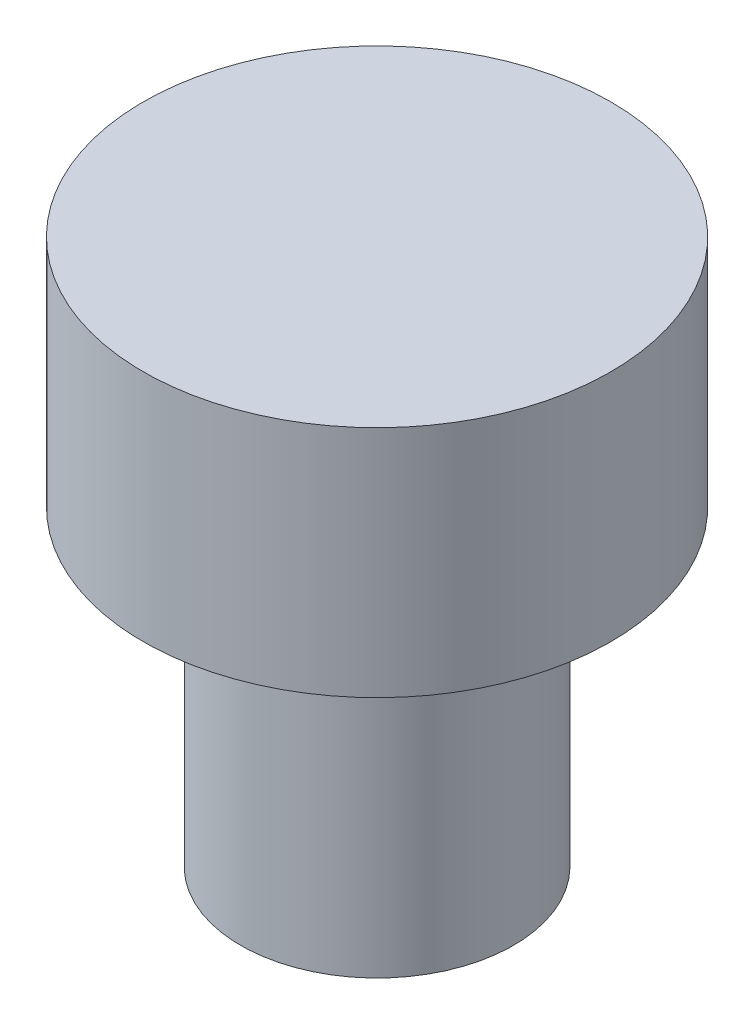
from build123d import *


with BuildPart() as part:
    # Sketch1 → Revolve1 (revolve)
    with BuildSketch(Plane.XY, mode=Mode.PRIVATE) as revolve1_sk:
        Polygon((0, 11.1125), (4.7625, 11.1125), (4.7625, 6.35), (2.778125, 6.35), (2.778125, 0), (0, 0), align=None)
    revolve(revolve1_sk.sketch.rotate(Axis((0, 0, 0), (0, 1, 0)), 90), axis=Axis((0, 0, 0), (0, 1, 0)))


solid = part.part
